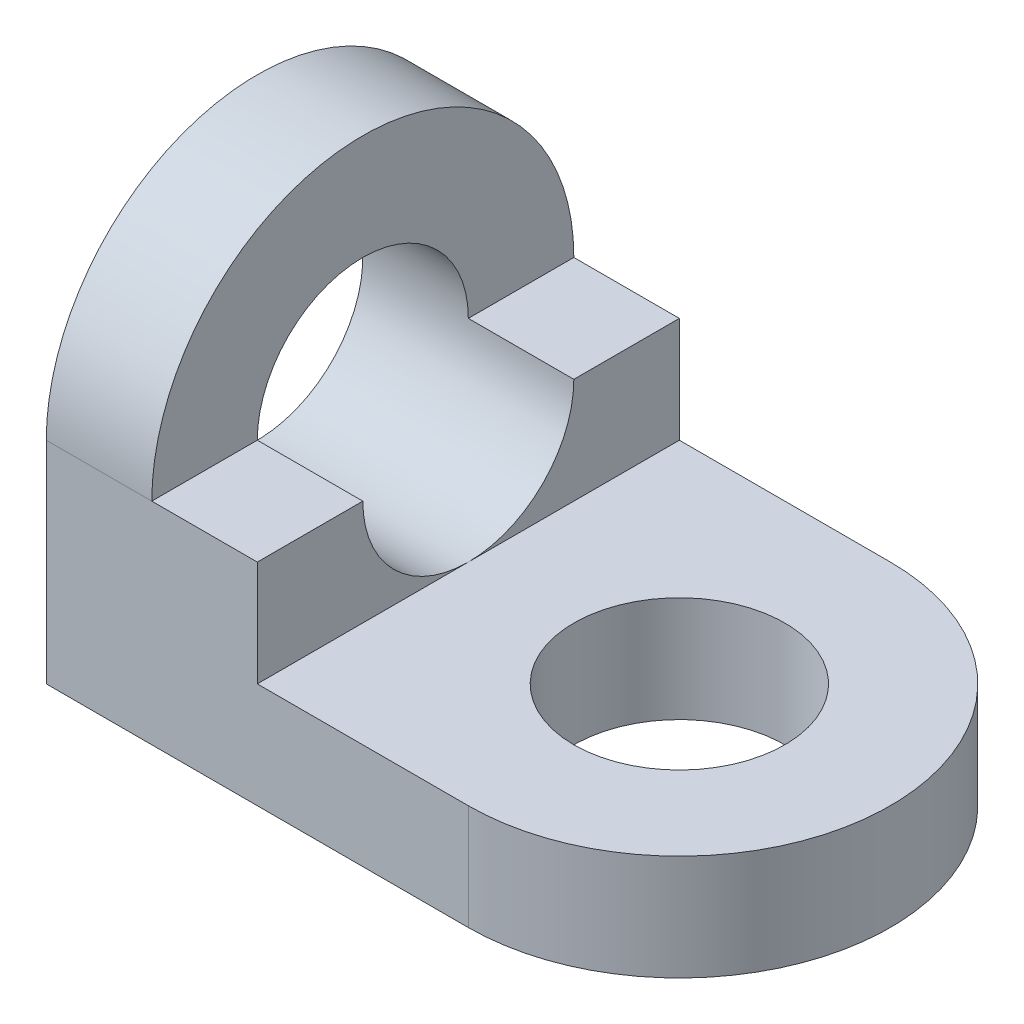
ISO-10303-21;
HEADER;
FILE_DESCRIPTION(('STEP AP214'),'2;1');
FILE_NAME('part.step','',(''),(''),'','','');
FILE_SCHEMA(('AUTOMOTIVE_DESIGN { 1 0 10303 214 1 1 1 1 }'));
ENDSEC;
DATA;
#1=APPLICATION_CONTEXT('core data for automotive mechanical design processes');
#2=APPLICATION_PROTOCOL_DEFINITION('international standard','automotive_design',2000,#1);
#3=PRODUCT_CONTEXT('',#1,'mechanical');
#4=PRODUCT('Part','Part','',(#3));
#5=PRODUCT_RELATED_PRODUCT_CATEGORY('part','',(#4));
#6=PRODUCT_DEFINITION_FORMATION('','',#4);
#7=PRODUCT_DEFINITION_CONTEXT('part definition',#1,'design');
#8=PRODUCT_DEFINITION('design','',#6,#7);
#9=PRODUCT_DEFINITION_SHAPE('','',#8);
#10=(LENGTH_UNIT() NAMED_UNIT(*) SI_UNIT(.MILLI.,.METRE.));
#11=(NAMED_UNIT(*) PLANE_ANGLE_UNIT() SI_UNIT($,.RADIAN.));
#12=(NAMED_UNIT(*) SI_UNIT($,.STERADIAN.) SOLID_ANGLE_UNIT());
#13=UNCERTAINTY_MEASURE_WITH_UNIT(LENGTH_MEASURE(1.E-05),#10,'distance_accuracy_value','');
#14=(GEOMETRIC_REPRESENTATION_CONTEXT(3) GLOBAL_UNCERTAINTY_ASSIGNED_CONTEXT((#13)) GLOBAL_UNIT_ASSIGNED_CONTEXT((#10,
#11,#12)) REPRESENTATION_CONTEXT('',''));
#15=CARTESIAN_POINT('',(0.,0.,0.));
#16=DIRECTION('',(0.,0.,1.));
#17=DIRECTION('',(1.,0.,0.));
#18=AXIS2_PLACEMENT_3D('',#15,#16,#17);
#19=CARTESIAN_POINT('',(20.,20.,20.));
#20=DIRECTION('',(0.,-1.,0.));
#21=DIRECTION('',(0.,0.,-1.));
#22=AXIS2_PLACEMENT_3D('',#19,#20,#21);
#23=PLANE('',#22);
#24=DIRECTION('',(0.,0.,1.));
#25=VECTOR('',#24,1.);
#26=CARTESIAN_POINT('',(20.,20.,20.));
#27=LINE('',#26,#25);
#28=CARTESIAN_POINT('',(20.,20.,10.));
#29=VERTEX_POINT('',#28);
#30=CARTESIAN_POINT('',(20.,20.,20.));
#31=VERTEX_POINT('',#30);
#32=EDGE_CURVE('E177',#29,#31,#27,.T.);
#33=ORIENTED_EDGE('',*,*,#32,.F.);
#34=DIRECTION('',(-1.,0.,0.));
#35=VECTOR('',#34,1.);
#36=CARTESIAN_POINT('',(60.,20.,10.));
#37=LINE('',#36,#35);
#38=CARTESIAN_POINT('',(10.,20.,10.));
#39=VERTEX_POINT('',#38);
#40=EDGE_CURVE('E45',#29,#39,#37,.T.);
#41=ORIENTED_EDGE('',*,*,#40,.T.);
#42=DIRECTION('',(0.,0.,1.));
#43=VECTOR('',#42,1.);
#44=CARTESIAN_POINT('',(10.,20.,20.));
#45=LINE('',#44,#43);
#46=CARTESIAN_POINT('',(10.,20.,20.));
#47=VERTEX_POINT('',#46);
#48=EDGE_CURVE('E187',#39,#47,#45,.T.);
#49=ORIENTED_EDGE('',*,*,#48,.T.);
#50=DIRECTION('',(-1.,0.,0.));
#51=VECTOR('',#50,1.);
#52=CARTESIAN_POINT('',(20.,20.,20.));
#53=LINE('',#52,#51);
#54=EDGE_CURVE('E183',#31,#47,#53,.T.);
#55=ORIENTED_EDGE('',*,*,#54,.F.);
#56=EDGE_LOOP('',(#33,#41,#49,#55));
#57=FACE_BOUND('',#56,.T.);
#58=ADVANCED_FACE('F30',(#57),#23,.F.);
#59=CARTESIAN_POINT('',(20.,20.,20.));
#60=DIRECTION('',(-1.,0.,0.));
#61=DIRECTION('',(0.,0.,1.));
#62=AXIS2_PLACEMENT_3D('',#59,#60,#61);
#63=PLANE('',#62);
#64=CARTESIAN_POINT('',(20.,20.,-20.));
#65=VERTEX_POINT('',#64);
#66=CARTESIAN_POINT('',(20.,20.,-10.));
#67=VERTEX_POINT('',#66);
#68=EDGE_CURVE('E169',#65,#67,#27,.T.);
#69=ORIENTED_EDGE('',*,*,#68,.T.);
#70=CARTESIAN_POINT('',(20.,20.,0.));
#71=DIRECTION('',(-1.,0.,0.));
#72=DIRECTION('',(0.,0.,1.));
#73=AXIS2_PLACEMENT_3D('',#70,#71,#72);
#74=CIRCLE('',#73,10.);
#75=CARTESIAN_POINT('',(20.,10.,0.));
#76=VERTEX_POINT('',#75);
#77=EDGE_CURVE('E11',#67,#76,#74,.T.);
#78=ORIENTED_EDGE('',*,*,#77,.T.);
#79=DIRECTION('',(0.,0.,-1.));
#80=VECTOR('',#79,1.);
#81=CARTESIAN_POINT('',(20.,10.,20.));
#82=LINE('',#81,#80);
#83=CARTESIAN_POINT('',(20.,10.,-20.));
#84=VERTEX_POINT('',#83);
#85=EDGE_CURVE('E166',#76,#84,#82,.T.);
#86=ORIENTED_EDGE('',*,*,#85,.T.);
#87=DIRECTION('',(0.,1.,0.));
#88=VECTOR('',#87,1.);
#89=CARTESIAN_POINT('',(20.,10.,-20.));
#90=LINE('',#89,#88);
#91=EDGE_CURVE('E176',#84,#65,#90,.T.);
#92=ORIENTED_EDGE('',*,*,#91,.T.);
#93=EDGE_LOOP('',(#69,#78,#86,#92));
#94=FACE_BOUND('',#93,.T.);
#95=ADVANCED_FACE('F165',(#94),#63,.F.);
#96=CARTESIAN_POINT('',(40.,10.,0.));
#97=DIRECTION('',(0.,-1.,0.));
#98=DIRECTION('',(0.,0.,-1.));
#99=AXIS2_PLACEMENT_3D('',#96,#97,#98);
#100=PLANE('',#99);
#101=CARTESIAN_POINT('',(40.,10.,0.));
#102=DIRECTION('',(0.,1.,0.));
#103=DIRECTION('',(0.,0.,1.));
#104=AXIS2_PLACEMENT_3D('',#101,#102,#103);
#105=CIRCLE('',#104,10.);
#106=CARTESIAN_POINT('',(40.,10.,10.));
#107=VERTEX_POINT('',#106);
#108=EDGE_CURVE('E355',#107,#107,#105,.T.);
#109=ORIENTED_EDGE('',*,*,#108,.F.);
#110=EDGE_LOOP('',(#109));
#111=FACE_BOUND('',#110,.T.);
#112=CARTESIAN_POINT('',(40.,10.,0.));
#113=DIRECTION('',(0.,1.,0.));
#114=DIRECTION('',(0.,0.,-1.));
#115=AXIS2_PLACEMENT_3D('',#112,#113,#114);
#116=CIRCLE('',#115,20.);
#117=CARTESIAN_POINT('',(40.,10.,20.));
#118=VERTEX_POINT('',#117);
#119=CARTESIAN_POINT('',(40.,10.,-20.));
#120=VERTEX_POINT('',#119);
#121=EDGE_CURVE('E54',#118,#120,#116,.T.);
#122=ORIENTED_EDGE('',*,*,#121,.T.);
#123=DIRECTION('',(-1.,0.,0.));
#124=VECTOR('',#123,1.);
#125=CARTESIAN_POINT('',(0.,10.,-20.));
#126=LINE('',#125,#124);
#127=EDGE_CURVE('E96',#120,#84,#126,.T.);
#128=ORIENTED_EDGE('',*,*,#127,.T.);
#129=ORIENTED_EDGE('',*,*,#85,.F.);
#130=CARTESIAN_POINT('',(20.,10.,20.));
#131=VERTEX_POINT('',#130);
#132=EDGE_CURVE('E172',#131,#76,#82,.T.);
#133=ORIENTED_EDGE('',*,*,#132,.F.);
#134=DIRECTION('',(1.,0.,0.));
#135=VECTOR('',#134,1.);
#136=CARTESIAN_POINT('',(40.,10.,20.));
#137=LINE('',#136,#135);
#138=EDGE_CURVE('E101',#131,#118,#137,.T.);
#139=ORIENTED_EDGE('',*,*,#138,.T.);
#140=EDGE_LOOP('',(#122,#128,#129,#133,#139));
#141=FACE_BOUND('',#140,.T.);
#142=ADVANCED_FACE('F171',(#111,#141),#100,.F.);
#143=CARTESIAN_POINT('',(10.,20.,0.));
#144=DIRECTION('',(1.,0.,0.));
#145=DIRECTION('',(0.,0.,-1.));
#146=AXIS2_PLACEMENT_3D('',#143,#144,#145);
#147=PLANE('',#146);
#148=CARTESIAN_POINT('',(10.,20.,0.));
#149=DIRECTION('',(1.,0.,0.));
#150=DIRECTION('',(0.,0.,-1.));
#151=AXIS2_PLACEMENT_3D('',#148,#149,#150);
#152=CIRCLE('',#151,10.);
#153=CARTESIAN_POINT('',(10.,20.,-10.));
#154=VERTEX_POINT('',#153);
#155=EDGE_CURVE('E208',#154,#39,#152,.T.);
#156=ORIENTED_EDGE('',*,*,#155,.F.);
#157=CARTESIAN_POINT('',(10.,20.,-20.));
#158=VERTEX_POINT('',#157);
#159=EDGE_CURVE('E184',#158,#154,#45,.T.);
#160=ORIENTED_EDGE('',*,*,#159,.F.);
#161=CARTESIAN_POINT('',(10.,20.,0.));
#162=DIRECTION('',(-1.,0.,0.));
#163=DIRECTION('',(0.,0.,-1.));
#164=AXIS2_PLACEMENT_3D('',#161,#162,#163);
#165=CIRCLE('',#164,20.);
#166=EDGE_CURVE('E191',#47,#158,#165,.T.);
#167=ORIENTED_EDGE('',*,*,#166,.F.);
#168=ORIENTED_EDGE('',*,*,#48,.F.);
#169=EDGE_LOOP('',(#156,#160,#167,#168));
#170=FACE_BOUND('',#169,.T.);
#171=ADVANCED_FACE('F218',(#170),#147,.T.);
#172=CARTESIAN_POINT('',(40.,10.,20.));
#173=DIRECTION('',(0.,0.,-1.));
#174=DIRECTION('',(-1.,0.,0.));
#175=AXIS2_PLACEMENT_3D('',#172,#173,#174);
#176=PLANE('',#175);
#177=ORIENTED_EDGE('',*,*,#138,.F.);
#178=DIRECTION('',(0.,-1.,0.));
#179=VECTOR('',#178,1.);
#180=CARTESIAN_POINT('',(20.,10.,20.));
#181=LINE('',#180,#179);
#182=EDGE_CURVE('E173',#31,#131,#181,.T.);
#183=ORIENTED_EDGE('',*,*,#182,.F.);
#184=ORIENTED_EDGE('',*,*,#54,.T.);
#185=DIRECTION('',(-1.,0.,0.));
#186=VECTOR('',#185,1.);
#187=CARTESIAN_POINT('',(10.,20.,20.));
#188=LINE('',#187,#186);
#189=CARTESIAN_POINT('',(0.,20.,20.));
#190=VERTEX_POINT('',#189);
#191=EDGE_CURVE('E128',#47,#190,#188,.T.);
#192=ORIENTED_EDGE('',*,*,#191,.T.);
#193=DIRECTION('',(0.,-1.,0.));
#194=VECTOR('',#193,1.);
#195=CARTESIAN_POINT('',(0.,10.,20.));
#196=LINE('',#195,#194);
#197=CARTESIAN_POINT('',(0.,0.,20.));
#198=VERTEX_POINT('',#197);
#199=EDGE_CURVE('E109',#190,#198,#196,.T.);
#200=ORIENTED_EDGE('',*,*,#199,.T.);
#201=DIRECTION('',(1.,0.,0.));
#202=VECTOR('',#201,1.);
#203=CARTESIAN_POINT('',(40.,0.,20.));
#204=LINE('',#203,#202);
#205=CARTESIAN_POINT('',(40.,0.,20.));
#206=VERTEX_POINT('',#205);
#207=EDGE_CURVE('E99',#198,#206,#204,.T.);
#208=ORIENTED_EDGE('',*,*,#207,.T.);
#209=DIRECTION('',(0.,-1.,0.));
#210=VECTOR('',#209,1.);
#211=CARTESIAN_POINT('',(40.,10.,20.));
#212=LINE('',#211,#210);
#213=EDGE_CURVE('E106',#118,#206,#212,.T.);
#214=ORIENTED_EDGE('',*,*,#213,.F.);
#215=EDGE_LOOP('',(#177,#183,#184,#192,#200,#208,#214));
#216=FACE_BOUND('',#215,.T.);
#217=ADVANCED_FACE('F32',(#216),#176,.F.);
#218=CARTESIAN_POINT('',(40.,10.,0.));
#219=DIRECTION('',(0.,-1.,0.));
#220=DIRECTION('',(0.,0.,-1.));
#221=AXIS2_PLACEMENT_3D('',#218,#219,#220);
#222=CYLINDRICAL_SURFACE('',#221,20.);
#223=CARTESIAN_POINT('',(40.,0.,0.));
#224=DIRECTION('',(0.,1.,0.));
#225=DIRECTION('',(0.,0.,-1.));
#226=AXIS2_PLACEMENT_3D('',#223,#224,#225);
#227=CIRCLE('',#226,20.);
#228=CARTESIAN_POINT('',(40.,0.,-20.));
#229=VERTEX_POINT('',#228);
#230=EDGE_CURVE('E87',#206,#229,#227,.T.);
#231=ORIENTED_EDGE('',*,*,#230,.T.);
#232=DIRECTION('',(0.,-1.,0.));
#233=VECTOR('',#232,1.);
#234=CARTESIAN_POINT('',(40.,10.,-20.));
#235=LINE('',#234,#233);
#236=EDGE_CURVE('E82',#120,#229,#235,.T.);
#237=ORIENTED_EDGE('',*,*,#236,.F.);
#238=ORIENTED_EDGE('',*,*,#121,.F.);
#239=ORIENTED_EDGE('',*,*,#213,.T.);
#240=EDGE_LOOP('',(#231,#237,#238,#239));
#241=FACE_BOUND('',#240,.T.);
#242=ADVANCED_FACE('F118',(#241),#222,.T.);
#243=CARTESIAN_POINT('',(0.,10.,-20.));
#244=DIRECTION('',(0.,0.,1.));
#245=DIRECTION('',(1.,0.,0.));
#246=AXIS2_PLACEMENT_3D('',#243,#244,#245);
#247=PLANE('',#246);
#248=DIRECTION('',(-1.,0.,0.));
#249=VECTOR('',#248,1.);
#250=CARTESIAN_POINT('',(0.,0.,-20.));
#251=LINE('',#250,#249);
#252=CARTESIAN_POINT('',(0.,0.,-20.));
#253=VERTEX_POINT('',#252);
#254=EDGE_CURVE('E74',#229,#253,#251,.T.);
#255=ORIENTED_EDGE('',*,*,#254,.T.);
#256=DIRECTION('',(0.,-1.,0.));
#257=VECTOR('',#256,1.);
#258=CARTESIAN_POINT('',(0.,10.,-20.));
#259=LINE('',#258,#257);
#260=CARTESIAN_POINT('',(0.,20.,-20.));
#261=VERTEX_POINT('',#260);
#262=EDGE_CURVE('E79',#261,#253,#259,.T.);
#263=ORIENTED_EDGE('',*,*,#262,.F.);
#264=DIRECTION('',(-1.,0.,0.));
#265=VECTOR('',#264,1.);
#266=CARTESIAN_POINT('',(10.,20.,-20.));
#267=LINE('',#266,#265);
#268=EDGE_CURVE('E116',#158,#261,#267,.T.);
#269=ORIENTED_EDGE('',*,*,#268,.F.);
#270=DIRECTION('',(-1.,0.,0.));
#271=VECTOR('',#270,1.);
#272=CARTESIAN_POINT('',(20.,20.,-20.));
#273=LINE('',#272,#271);
#274=EDGE_CURVE('E189',#65,#158,#273,.T.);
#275=ORIENTED_EDGE('',*,*,#274,.F.);
#276=ORIENTED_EDGE('',*,*,#91,.F.);
#277=ORIENTED_EDGE('',*,*,#127,.F.);
#278=ORIENTED_EDGE('',*,*,#236,.T.);
#279=EDGE_LOOP('',(#255,#263,#269,#275,#276,#277,#278));
#280=FACE_BOUND('',#279,.T.);
#281=ADVANCED_FACE('F76',(#280),#247,.F.);
#282=CARTESIAN_POINT('',(0.,10.,0.));
#283=DIRECTION('',(1.,0.,0.));
#284=DIRECTION('',(0.,0.,-1.));
#285=AXIS2_PLACEMENT_3D('',#282,#283,#284);
#286=PLANE('',#285);
#287=CARTESIAN_POINT('',(0.,20.,0.));
#288=DIRECTION('',(-1.,0.,0.));
#289=DIRECTION('',(0.,0.,1.));
#290=AXIS2_PLACEMENT_3D('',#287,#288,#289);
#291=CIRCLE('',#290,10.);
#292=CARTESIAN_POINT('',(0.,20.,10.));
#293=VERTEX_POINT('',#292);
#294=EDGE_CURVE('E206',#293,#293,#291,.T.);
#295=ORIENTED_EDGE('',*,*,#294,.F.);
#296=EDGE_LOOP('',(#295));
#297=FACE_BOUND('',#296,.T.);
#298=DIRECTION('',(0.,0.,1.));
#299=VECTOR('',#298,1.);
#300=CARTESIAN_POINT('',(0.,0.,0.));
#301=LINE('',#300,#299);
#302=EDGE_CURVE('E86',#253,#198,#301,.T.);
#303=ORIENTED_EDGE('',*,*,#302,.T.);
#304=ORIENTED_EDGE('',*,*,#199,.F.);
#305=CARTESIAN_POINT('',(0.,20.,0.));
#306=DIRECTION('',(-1.,0.,0.));
#307=DIRECTION('',(0.,0.,-1.));
#308=AXIS2_PLACEMENT_3D('',#305,#306,#307);
#309=CIRCLE('',#308,20.);
#310=EDGE_CURVE('E95',#190,#261,#309,.T.);
#311=ORIENTED_EDGE('',*,*,#310,.T.);
#312=ORIENTED_EDGE('',*,*,#262,.T.);
#313=EDGE_LOOP('',(#303,#304,#311,#312));
#314=FACE_BOUND('',#313,.T.);
#315=ADVANCED_FACE('F91',(#297,#314),#286,.F.);
#316=CARTESIAN_POINT('',(40.,0.,0.));
#317=DIRECTION('',(0.,-1.,0.));
#318=DIRECTION('',(0.,0.,-1.));
#319=AXIS2_PLACEMENT_3D('',#316,#317,#318);
#320=PLANE('',#319);
#321=CARTESIAN_POINT('',(40.,0.,0.));
#322=DIRECTION('',(0.,1.,0.));
#323=DIRECTION('',(0.,0.,1.));
#324=AXIS2_PLACEMENT_3D('',#321,#322,#323);
#325=CIRCLE('',#324,10.);
#326=CARTESIAN_POINT('',(40.,0.,10.));
#327=VERTEX_POINT('',#326);
#328=EDGE_CURVE('E211',#327,#327,#325,.T.);
#329=ORIENTED_EDGE('',*,*,#328,.T.);
#330=EDGE_LOOP('',(#329));
#331=FACE_BOUND('',#330,.T.);
#332=ORIENTED_EDGE('',*,*,#207,.F.);
#333=ORIENTED_EDGE('',*,*,#302,.F.);
#334=ORIENTED_EDGE('',*,*,#254,.F.);
#335=ORIENTED_EDGE('',*,*,#230,.F.);
#336=EDGE_LOOP('',(#332,#333,#334,#335));
#337=FACE_BOUND('',#336,.T.);
#338=ADVANCED_FACE('F98',(#331,#337),#320,.T.);
#339=CARTESIAN_POINT('',(10.,20.,0.));
#340=DIRECTION('',(-1.,0.,0.));
#341=DIRECTION('',(0.,0.,1.));
#342=AXIS2_PLACEMENT_3D('',#339,#340,#341);
#343=CYLINDRICAL_SURFACE('',#342,20.);
#344=ORIENTED_EDGE('',*,*,#310,.F.);
#345=ORIENTED_EDGE('',*,*,#191,.F.);
#346=ORIENTED_EDGE('',*,*,#166,.T.);
#347=ORIENTED_EDGE('',*,*,#268,.T.);
#348=EDGE_LOOP('',(#344,#345,#346,#347));
#349=FACE_BOUND('',#348,.T.);
#350=ADVANCED_FACE('F198',(#349),#343,.T.);
#351=ORIENTED_EDGE('',*,*,#159,.T.);
#352=DIRECTION('',(-1.,0.,0.));
#353=VECTOR('',#352,1.);
#354=CARTESIAN_POINT('',(60.,20.,-10.));
#355=LINE('',#354,#353);
#356=EDGE_CURVE('E204',#154,#67,#355,.F.);
#357=ORIENTED_EDGE('',*,*,#356,.T.);
#358=ORIENTED_EDGE('',*,*,#68,.F.);
#359=ORIENTED_EDGE('',*,*,#274,.T.);
#360=EDGE_LOOP('',(#351,#357,#358,#359));
#361=FACE_BOUND('',#360,.T.);
#362=ADVANCED_FACE('F203',(#361),#23,.F.);
#363=ORIENTED_EDGE('',*,*,#132,.T.);
#364=EDGE_CURVE('E34',#76,#29,#74,.T.);
#365=ORIENTED_EDGE('',*,*,#364,.T.);
#366=ORIENTED_EDGE('',*,*,#32,.T.);
#367=ORIENTED_EDGE('',*,*,#182,.T.);
#368=EDGE_LOOP('',(#363,#365,#366,#367));
#369=FACE_BOUND('',#368,.T.);
#370=ADVANCED_FACE('F175',(#369),#63,.F.);
#371=CARTESIAN_POINT('',(60.,20.,0.));
#372=DIRECTION('',(-1.,0.,0.));
#373=DIRECTION('',(0.,0.,1.));
#374=AXIS2_PLACEMENT_3D('',#371,#372,#373);
#375=CYLINDRICAL_SURFACE('',#374,10.);
#376=ORIENTED_EDGE('',*,*,#155,.T.);
#377=ORIENTED_EDGE('',*,*,#40,.F.);
#378=ORIENTED_EDGE('',*,*,#364,.F.);
#379=ORIENTED_EDGE('',*,*,#77,.F.);
#380=ORIENTED_EDGE('',*,*,#356,.F.);
#381=EDGE_LOOP('',(#376,#377,#378,#379,#380));
#382=FACE_BOUND('',#381,.T.);
#383=ORIENTED_EDGE('',*,*,#294,.T.);
#384=EDGE_LOOP('',(#383));
#385=FACE_BOUND('',#384,.T.);
#386=ADVANCED_FACE('F156',(#382,#385),#375,.F.);
#387=CARTESIAN_POINT('',(40.,0.,0.));
#388=DIRECTION('',(0.,1.,0.));
#389=DIRECTION('',(0.,0.,1.));
#390=AXIS2_PLACEMENT_3D('',#387,#388,#389);
#391=CYLINDRICAL_SURFACE('',#390,10.);
#392=ORIENTED_EDGE('',*,*,#328,.F.);
#393=EDGE_LOOP('',(#392));
#394=FACE_BOUND('',#393,.T.);
#395=ORIENTED_EDGE('',*,*,#108,.T.);
#396=EDGE_LOOP('',(#395));
#397=FACE_BOUND('',#396,.T.);
#398=ADVANCED_FACE('F277',(#394,#397),#391,.F.);
#399=CLOSED_SHELL('',(#58,#95,#142,#171,#217,#242,#281,#315,#338,#350,#362,#370,#386,#398));
#400=MANIFOLD_SOLID_BREP('B2',#399);
#401=ADVANCED_BREP_SHAPE_REPRESENTATION('',(#18,#400),#14);
#402=SHAPE_DEFINITION_REPRESENTATION(#9,#401);
ENDSEC;
END-ISO-10303-21;
